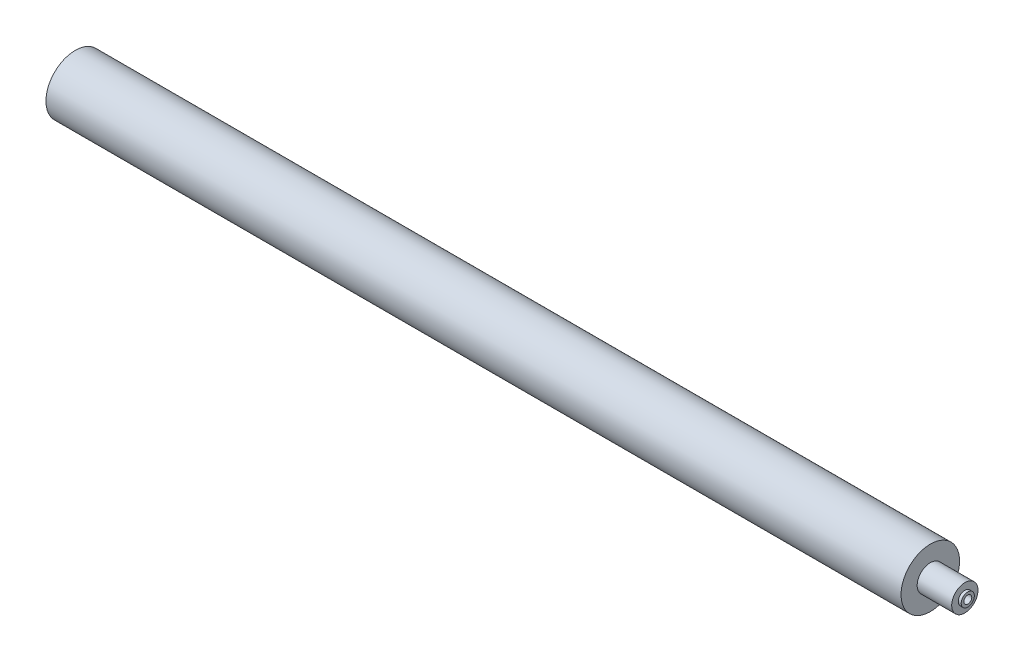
ISO-10303-21;
HEADER;
FILE_DESCRIPTION(('STEP AP214'),'2;1');
FILE_NAME('part.step','',(''),(''),'','','');
FILE_SCHEMA(('AUTOMOTIVE_DESIGN { 1 0 10303 214 1 1 1 1 }'));
ENDSEC;
DATA;
#1=APPLICATION_CONTEXT('core data for automotive mechanical design processes');
#2=APPLICATION_PROTOCOL_DEFINITION('international standard','automotive_design',2000,#1);
#3=PRODUCT_CONTEXT('',#1,'mechanical');
#4=PRODUCT('Part','Part','',(#3));
#5=PRODUCT_RELATED_PRODUCT_CATEGORY('part','',(#4));
#6=PRODUCT_DEFINITION_FORMATION('','',#4);
#7=PRODUCT_DEFINITION_CONTEXT('part definition',#1,'design');
#8=PRODUCT_DEFINITION('design','',#6,#7);
#9=PRODUCT_DEFINITION_SHAPE('','',#8);
#10=(LENGTH_UNIT() NAMED_UNIT(*) SI_UNIT(.MILLI.,.METRE.));
#11=(NAMED_UNIT(*) PLANE_ANGLE_UNIT() SI_UNIT($,.RADIAN.));
#12=(NAMED_UNIT(*) SI_UNIT($,.STERADIAN.) SOLID_ANGLE_UNIT());
#13=UNCERTAINTY_MEASURE_WITH_UNIT(LENGTH_MEASURE(1.E-05),#10,'distance_accuracy_value','');
#14=(GEOMETRIC_REPRESENTATION_CONTEXT(3) GLOBAL_UNCERTAINTY_ASSIGNED_CONTEXT((#13)) GLOBAL_UNIT_ASSIGNED_CONTEXT((#10,
#11,#12)) REPRESENTATION_CONTEXT('',''));
#15=CARTESIAN_POINT('',(0.,0.,0.));
#16=DIRECTION('',(0.,0.,1.));
#17=DIRECTION('',(1.,0.,0.));
#18=AXIS2_PLACEMENT_3D('',#15,#16,#17);
#19=CARTESIAN_POINT('',(1352.5,0.,0.));
#20=DIRECTION('',(1.,0.,0.));
#21=DIRECTION('',(0.,0.,-1.));
#22=AXIS2_PLACEMENT_3D('',#19,#20,#21);
#23=PLANE('',#22);
#24=CARTESIAN_POINT('',(1352.5,0.,0.));
#25=DIRECTION('',(1.,0.,0.));
#26=DIRECTION('',(0.,0.,-1.));
#27=AXIS2_PLACEMENT_3D('',#24,#25,#26);
#28=CIRCLE('',#27,20.);
#29=CARTESIAN_POINT('',(1352.5,0.,-20.));
#30=VERTEX_POINT('',#29);
#31=EDGE_CURVE('E50',#30,#30,#28,.T.);
#32=ORIENTED_EDGE('',*,*,#31,.T.);
#33=EDGE_LOOP('',(#32));
#34=FACE_BOUND('',#33,.T.);
#35=CARTESIAN_POINT('',(1352.5,0.,0.));
#36=DIRECTION('',(1.,0.,0.));
#37=DIRECTION('',(0.,0.,-1.));
#38=AXIS2_PLACEMENT_3D('',#35,#36,#37);
#39=CIRCLE('',#38,10.);
#40=CARTESIAN_POINT('',(1352.5,0.,-10.));
#41=VERTEX_POINT('',#40);
#42=EDGE_CURVE('E59',#41,#41,#39,.T.);
#43=ORIENTED_EDGE('',*,*,#42,.F.);
#44=EDGE_LOOP('',(#43));
#45=FACE_BOUND('',#44,.T.);
#46=ADVANCED_FACE('F30',(#34,#45),#23,.T.);
#47=CARTESIAN_POINT('',(1300.,0.,0.));
#48=DIRECTION('',(1.,0.,0.));
#49=DIRECTION('',(0.,0.,-1.));
#50=AXIS2_PLACEMENT_3D('',#47,#48,#49);
#51=PLANE('',#50);
#52=CARTESIAN_POINT('',(1300.,0.,0.));
#53=DIRECTION('',(1.,0.,0.));
#54=DIRECTION('',(0.,0.,-1.));
#55=AXIS2_PLACEMENT_3D('',#52,#53,#54);
#56=CIRCLE('',#55,44.5);
#57=CARTESIAN_POINT('',(1300.,0.,-44.5));
#58=VERTEX_POINT('',#57);
#59=EDGE_CURVE('E37',#58,#58,#56,.T.);
#60=ORIENTED_EDGE('',*,*,#59,.T.);
#61=EDGE_LOOP('',(#60));
#62=FACE_BOUND('',#61,.T.);
#63=CARTESIAN_POINT('',(1300.,0.,0.));
#64=DIRECTION('',(1.,0.,0.));
#65=DIRECTION('',(0.,0.,-1.));
#66=AXIS2_PLACEMENT_3D('',#63,#64,#65);
#67=CIRCLE('',#66,20.);
#68=CARTESIAN_POINT('',(1300.,0.,-20.));
#69=VERTEX_POINT('',#68);
#70=EDGE_CURVE('E53',#69,#69,#67,.T.);
#71=ORIENTED_EDGE('',*,*,#70,.F.);
#72=EDGE_LOOP('',(#71));
#73=FACE_BOUND('',#72,.T.);
#74=ADVANCED_FACE('F92',(#62,#73),#51,.T.);
#75=CARTESIAN_POINT('',(0.,0.,0.));
#76=DIRECTION('',(1.,0.,0.));
#77=DIRECTION('',(0.,0.,-1.));
#78=AXIS2_PLACEMENT_3D('',#75,#76,#77);
#79=PLANE('',#78);
#80=CARTESIAN_POINT('',(0.,0.,0.));
#81=DIRECTION('',(1.,0.,0.));
#82=DIRECTION('',(0.,0.,-1.));
#83=AXIS2_PLACEMENT_3D('',#80,#81,#82);
#84=CIRCLE('',#83,44.5);
#85=CARTESIAN_POINT('',(0.,0.,-44.5));
#86=VERTEX_POINT('',#85);
#87=EDGE_CURVE('E41',#86,#86,#84,.T.);
#88=ORIENTED_EDGE('',*,*,#87,.F.);
#89=EDGE_LOOP('',(#88));
#90=FACE_BOUND('',#89,.T.);
#91=CARTESIAN_POINT('',(0.,0.,0.));
#92=DIRECTION('',(1.,0.,0.));
#93=DIRECTION('',(0.,0.,-1.));
#94=AXIS2_PLACEMENT_3D('',#91,#92,#93);
#95=CIRCLE('',#94,10.);
#96=CARTESIAN_POINT('',(0.,0.,-10.));
#97=VERTEX_POINT('',#96);
#98=EDGE_CURVE('E10',#97,#97,#95,.F.);
#99=ORIENTED_EDGE('',*,*,#98,.F.);
#100=EDGE_LOOP('',(#99));
#101=FACE_BOUND('',#100,.T.);
#102=ADVANCED_FACE('F98',(#90,#101),#79,.F.);
#103=CARTESIAN_POINT('',(1300.,0.,0.));
#104=DIRECTION('',(-1.,0.,0.));
#105=DIRECTION('',(0.,0.,1.));
#106=AXIS2_PLACEMENT_3D('',#103,#104,#105);
#107=CYLINDRICAL_SURFACE('',#106,44.5);
#108=ORIENTED_EDGE('',*,*,#59,.F.);
#109=EDGE_LOOP('',(#108));
#110=FACE_BOUND('',#109,.T.);
#111=ORIENTED_EDGE('',*,*,#87,.T.);
#112=EDGE_LOOP('',(#111));
#113=FACE_BOUND('',#112,.T.);
#114=ADVANCED_FACE('F32',(#110,#113),#107,.T.);
#115=CARTESIAN_POINT('',(-3.,0.,0.));
#116=DIRECTION('',(1.,0.,0.));
#117=DIRECTION('',(0.,0.,-1.));
#118=AXIS2_PLACEMENT_3D('',#115,#116,#117);
#119=CYLINDRICAL_SURFACE('',#118,10.);
#120=CARTESIAN_POINT('',(-3.,0.,0.));
#121=DIRECTION('',(-1.,0.,0.));
#122=DIRECTION('',(0.,0.,1.));
#123=AXIS2_PLACEMENT_3D('',#120,#121,#122);
#124=CIRCLE('',#123,10.);
#125=CARTESIAN_POINT('',(-3.,0.,10.));
#126=VERTEX_POINT('',#125);
#127=EDGE_CURVE('E45',#126,#126,#124,.T.);
#128=ORIENTED_EDGE('',*,*,#127,.F.);
#129=EDGE_LOOP('',(#128));
#130=FACE_BOUND('',#129,.T.);
#131=ORIENTED_EDGE('',*,*,#98,.T.);
#132=EDGE_LOOP('',(#131));
#133=FACE_BOUND('',#132,.T.);
#134=ADVANCED_FACE('F106',(#130,#133),#119,.T.);
#135=CARTESIAN_POINT('',(-3.,0.,0.));
#136=DIRECTION('',(-1.,0.,0.));
#137=DIRECTION('',(0.,0.,1.));
#138=AXIS2_PLACEMENT_3D('',#135,#136,#137);
#139=PLANE('',#138);
#140=CARTESIAN_POINT('',(-3.,0.,0.));
#141=DIRECTION('',(-1.,0.,0.));
#142=DIRECTION('',(0.,0.,1.));
#143=AXIS2_PLACEMENT_3D('',#140,#141,#142);
#144=CIRCLE('',#143,6.);
#145=CARTESIAN_POINT('',(-3.,0.,6.));
#146=VERTEX_POINT('',#145);
#147=EDGE_CURVE('E65',#146,#146,#144,.T.);
#148=ORIENTED_EDGE('',*,*,#147,.F.);
#149=EDGE_LOOP('',(#148));
#150=FACE_BOUND('',#149,.T.);
#151=ORIENTED_EDGE('',*,*,#127,.T.);
#152=EDGE_LOOP('',(#151));
#153=FACE_BOUND('',#152,.T.);
#154=ADVANCED_FACE('F102',(#150,#153),#139,.T.);
#155=CARTESIAN_POINT('',(1352.5,0.,0.));
#156=DIRECTION('',(-1.,0.,0.));
#157=DIRECTION('',(0.,0.,1.));
#158=AXIS2_PLACEMENT_3D('',#155,#156,#157);
#159=CYLINDRICAL_SURFACE('',#158,20.);
#160=ORIENTED_EDGE('',*,*,#31,.F.);
#161=EDGE_LOOP('',(#160));
#162=FACE_BOUND('',#161,.T.);
#163=ORIENTED_EDGE('',*,*,#70,.T.);
#164=EDGE_LOOP('',(#163));
#165=FACE_BOUND('',#164,.T.);
#166=ADVANCED_FACE('F87',(#162,#165),#159,.T.);
#167=CARTESIAN_POINT('',(1357.,0.,0.));
#168=DIRECTION('',(-1.,0.,0.));
#169=DIRECTION('',(0.,0.,1.));
#170=AXIS2_PLACEMENT_3D('',#167,#168,#169);
#171=CYLINDRICAL_SURFACE('',#170,10.);
#172=CARTESIAN_POINT('',(1357.,0.,0.));
#173=DIRECTION('',(1.,0.,0.));
#174=DIRECTION('',(0.,0.,-1.));
#175=AXIS2_PLACEMENT_3D('',#172,#173,#174);
#176=CIRCLE('',#175,10.);
#177=CARTESIAN_POINT('',(1357.,0.,-10.));
#178=VERTEX_POINT('',#177);
#179=EDGE_CURVE('E56',#178,#178,#176,.T.);
#180=ORIENTED_EDGE('',*,*,#179,.F.);
#181=EDGE_LOOP('',(#180));
#182=FACE_BOUND('',#181,.T.);
#183=ORIENTED_EDGE('',*,*,#42,.T.);
#184=EDGE_LOOP('',(#183));
#185=FACE_BOUND('',#184,.T.);
#186=ADVANCED_FACE('F81',(#182,#185),#171,.T.);
#187=CARTESIAN_POINT('',(1357.,0.,0.));
#188=DIRECTION('',(1.,0.,0.));
#189=DIRECTION('',(0.,0.,-1.));
#190=AXIS2_PLACEMENT_3D('',#187,#188,#189);
#191=PLANE('',#190);
#192=CARTESIAN_POINT('',(1357.,0.,0.));
#193=DIRECTION('',(1.,0.,0.));
#194=DIRECTION('',(0.,0.,-1.));
#195=AXIS2_PLACEMENT_3D('',#192,#193,#194);
#196=CIRCLE('',#195,6.);
#197=CARTESIAN_POINT('',(1357.,0.,-6.));
#198=VERTEX_POINT('',#197);
#199=EDGE_CURVE('E71',#198,#198,#196,.T.);
#200=ORIENTED_EDGE('',*,*,#199,.F.);
#201=EDGE_LOOP('',(#200));
#202=FACE_BOUND('',#201,.T.);
#203=ORIENTED_EDGE('',*,*,#179,.T.);
#204=EDGE_LOOP('',(#203));
#205=FACE_BOUND('',#204,.T.);
#206=ADVANCED_FACE('F77',(#202,#205),#191,.T.);
#207=CARTESIAN_POINT('',(27.,0.,0.));
#208=DIRECTION('',(-1.,0.,0.));
#209=DIRECTION('',(0.,0.,1.));
#210=AXIS2_PLACEMENT_3D('',#207,#208,#209);
#211=CYLINDRICAL_SURFACE('',#210,6.);
#212=CARTESIAN_POINT('',(27.,0.,0.));
#213=DIRECTION('',(-1.,0.,0.));
#214=DIRECTION('',(0.,0.,1.));
#215=AXIS2_PLACEMENT_3D('',#212,#213,#214);
#216=CIRCLE('',#215,6.);
#217=CARTESIAN_POINT('',(27.,0.,6.));
#218=VERTEX_POINT('',#217);
#219=EDGE_CURVE('E62',#218,#218,#216,.T.);
#220=ORIENTED_EDGE('',*,*,#219,.F.);
#221=EDGE_LOOP('',(#220));
#222=FACE_BOUND('',#221,.T.);
#223=ORIENTED_EDGE('',*,*,#147,.T.);
#224=EDGE_LOOP('',(#223));
#225=FACE_BOUND('',#224,.T.);
#226=ADVANCED_FACE('F80',(#222,#225),#211,.F.);
#227=CARTESIAN_POINT('',(27.,0.,0.));
#228=DIRECTION('',(-1.,0.,0.));
#229=DIRECTION('',(0.,0.,1.));
#230=AXIS2_PLACEMENT_3D('',#227,#228,#229);
#231=PLANE('',#230);
#232=ORIENTED_EDGE('',*,*,#219,.T.);
#233=EDGE_LOOP('',(#232));
#234=FACE_BOUND('',#233,.T.);
#235=ADVANCED_FACE('F151',(#234),#231,.T.);
#236=CARTESIAN_POINT('',(1327.,0.,0.));
#237=DIRECTION('',(1.,0.,0.));
#238=DIRECTION('',(0.,0.,-1.));
#239=AXIS2_PLACEMENT_3D('',#236,#237,#238);
#240=CYLINDRICAL_SURFACE('',#239,6.);
#241=CARTESIAN_POINT('',(1327.,0.,0.));
#242=DIRECTION('',(1.,0.,0.));
#243=DIRECTION('',(0.,0.,-1.));
#244=AXIS2_PLACEMENT_3D('',#241,#242,#243);
#245=CIRCLE('',#244,6.);
#246=CARTESIAN_POINT('',(1327.,0.,-6.));
#247=VERTEX_POINT('',#246);
#248=EDGE_CURVE('E68',#247,#247,#245,.T.);
#249=ORIENTED_EDGE('',*,*,#248,.F.);
#250=EDGE_LOOP('',(#249));
#251=FACE_BOUND('',#250,.T.);
#252=ORIENTED_EDGE('',*,*,#199,.T.);
#253=EDGE_LOOP('',(#252));
#254=FACE_BOUND('',#253,.T.);
#255=ADVANCED_FACE('F75',(#251,#254),#240,.F.);
#256=CARTESIAN_POINT('',(1327.,0.,0.));
#257=DIRECTION('',(1.,0.,0.));
#258=DIRECTION('',(0.,0.,-1.));
#259=AXIS2_PLACEMENT_3D('',#256,#257,#258);
#260=PLANE('',#259);
#261=ORIENTED_EDGE('',*,*,#248,.T.);
#262=EDGE_LOOP('',(#261));
#263=FACE_BOUND('',#262,.T.);
#264=ADVANCED_FACE('F164',(#263),#260,.T.);
#265=CLOSED_SHELL('',(#46,#74,#102,#114,#134,#154,#166,#186,#206,#226,#235,#255,#264));
#266=MANIFOLD_SOLID_BREP('B2',#265);
#267=ADVANCED_BREP_SHAPE_REPRESENTATION('',(#18,#266),#14);
#268=SHAPE_DEFINITION_REPRESENTATION(#9,#267);
ENDSEC;
END-ISO-10303-21;
